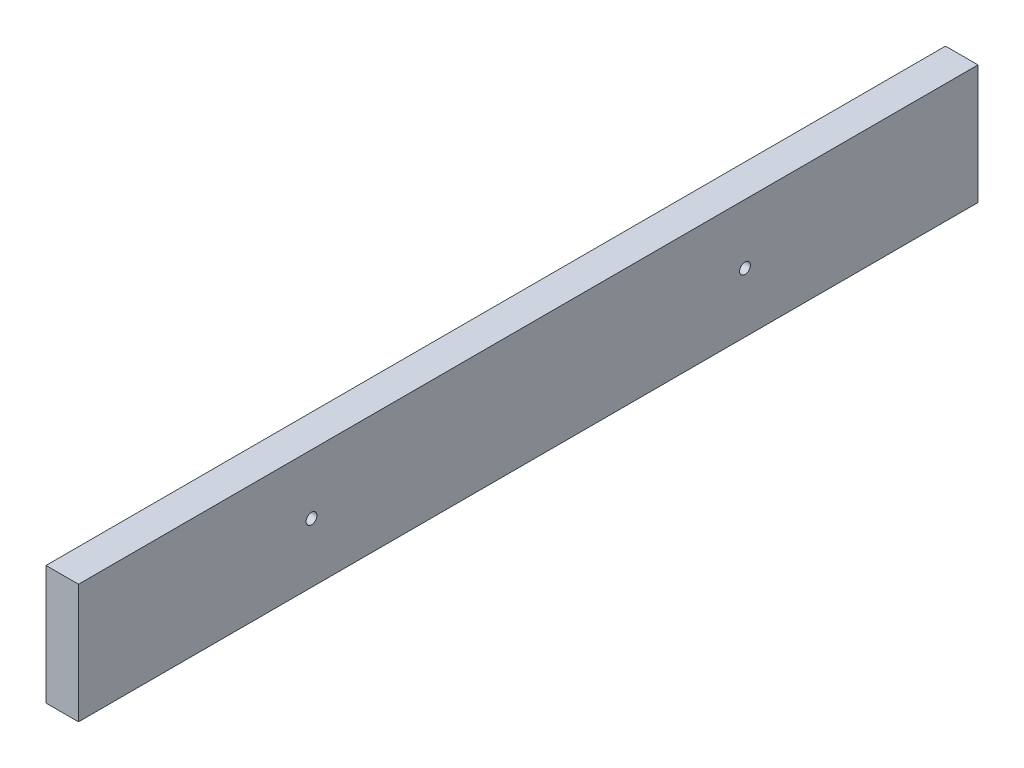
from build123d import *

# Parameters (mm, degrees)
SKETCH2_W           = 38.1
SKETCH2_H           = 139.7
BOSS_EXTRUDE1_DEPTH = 1054.1
SKETCH3_R           = 6.35
CUT_EXTRUDE1_DEPTH  = 1058.098596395


with BuildPart() as part:
    # Sketch2 → Boss-Extrude1 (new body)
    with BuildSketch(Plane.XY):
        Rectangle(SKETCH2_W, SKETCH2_H)
    extrude(amount=BOSS_EXTRUDE1_DEPTH)

    # Sketch3 → Cut-Extrude1 (cut, through all)
    with BuildSketch(Plane.ZY.offset(19.05)):
        with Locations(Location((273.05, 0, 0), (0, 0, 270))):
            Circle(SKETCH3_R)
        with Locations(Location((781.05, 0, 0), (0, 0, 270))):
            Circle(SKETCH3_R)
    extrude(amount=-CUT_EXTRUDE1_DEPTH, mode=Mode.SUBTRACT)


solid = part.part
